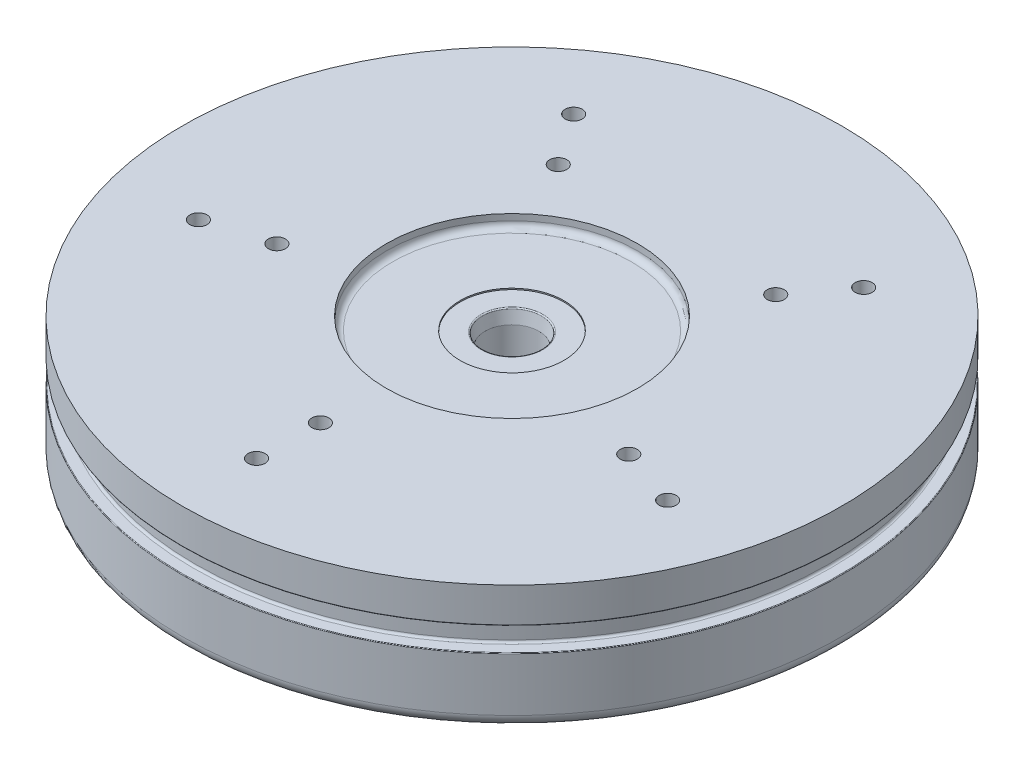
ISO-10303-21;
HEADER;
FILE_DESCRIPTION(('STEP AP214'),'2;1');
FILE_NAME('part.step','',(''),(''),'','','');
FILE_SCHEMA(('AUTOMOTIVE_DESIGN { 1 0 10303 214 1 1 1 1 }'));
ENDSEC;
DATA;
#1=APPLICATION_CONTEXT('core data for automotive mechanical design processes');
#2=APPLICATION_PROTOCOL_DEFINITION('international standard','automotive_design',2000,#1);
#3=PRODUCT_CONTEXT('',#1,'mechanical');
#4=PRODUCT('Part','Part','',(#3));
#5=PRODUCT_RELATED_PRODUCT_CATEGORY('part','',(#4));
#6=PRODUCT_DEFINITION_FORMATION('','',#4);
#7=PRODUCT_DEFINITION_CONTEXT('part definition',#1,'design');
#8=PRODUCT_DEFINITION('design','',#6,#7);
#9=PRODUCT_DEFINITION_SHAPE('','',#8);
#10=(LENGTH_UNIT() NAMED_UNIT(*) SI_UNIT(.MILLI.,.METRE.));
#11=(NAMED_UNIT(*) PLANE_ANGLE_UNIT() SI_UNIT($,.RADIAN.));
#12=(NAMED_UNIT(*) SI_UNIT($,.STERADIAN.) SOLID_ANGLE_UNIT());
#13=UNCERTAINTY_MEASURE_WITH_UNIT(LENGTH_MEASURE(1.E-05),#10,'distance_accuracy_value','');
#14=(GEOMETRIC_REPRESENTATION_CONTEXT(3) GLOBAL_UNCERTAINTY_ASSIGNED_CONTEXT((#13)) GLOBAL_UNIT_ASSIGNED_CONTEXT((#10,
#11,#12)) REPRESENTATION_CONTEXT('',''));
#15=CARTESIAN_POINT('',(0.,0.,0.));
#16=DIRECTION('',(0.,0.,1.));
#17=DIRECTION('',(1.,0.,0.));
#18=AXIS2_PLACEMENT_3D('',#15,#16,#17);
#19=CARTESIAN_POINT('',(-66.675,25.4,0.));
#20=DIRECTION('',(0.,-1.,0.));
#21=DIRECTION('',(0.,0.,-1.));
#22=AXIS2_PLACEMENT_3D('',#19,#20,#21);
#23=PLANE('',#22);
#24=CARTESIAN_POINT('',(0.,25.4,0.));
#25=DIRECTION('',(0.,1.,0.));
#26=DIRECTION('',(0.,0.,1.));
#27=AXIS2_PLACEMENT_3D('',#24,#25,#26);
#28=CIRCLE('',#27,25.4);
#29=CARTESIAN_POINT('',(0.,25.4,25.4));
#30=VERTEX_POINT('',#29);
#31=EDGE_CURVE('E94',#30,#30,#28,.T.);
#32=ORIENTED_EDGE('',*,*,#31,.F.);
#33=EDGE_LOOP('',(#32));
#34=FACE_BOUND('',#33,.T.);
#35=CARTESIAN_POINT('',(22.9291523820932,25.4,-30.4280129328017));
#36=DIRECTION('',(0.,1.,0.));
#37=DIRECTION('',(0.,0.,1.));
#38=AXIS2_PLACEMENT_3D('',#35,#36,#37);
#39=CIRCLE('',#38,1.72719999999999);
#40=CARTESIAN_POINT('',(22.9291523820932,25.4,-28.7008129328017));
#41=VERTEX_POINT('',#40);
#42=EDGE_CURVE('E88',#41,#41,#39,.T.);
#43=ORIENTED_EDGE('',*,*,#42,.F.);
#44=EDGE_LOOP('',(#43));
#45=FACE_BOUND('',#44,.T.);
#46=CARTESIAN_POINT('',(-21.8532622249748,25.4,-31.2096928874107));
#47=DIRECTION('',(0.,1.,0.));
#48=DIRECTION('',(0.,0.,1.));
#49=AXIS2_PLACEMENT_3D('',#46,#47,#48);
#50=CIRCLE('',#49,1.72719999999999);
#51=CARTESIAN_POINT('',(-21.8532622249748,25.4,-29.4824928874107));
#52=VERTEX_POINT('',#51);
#53=EDGE_CURVE('E100',#52,#52,#50,.T.);
#54=ORIENTED_EDGE('',*,*,#53,.F.);
#55=EDGE_LOOP('',(#54));
#56=FACE_BOUND('',#55,.T.);
#57=CARTESIAN_POINT('',(-29.137682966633,25.4,-41.6129238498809));
#58=DIRECTION('',(0.,1.,0.));
#59=DIRECTION('',(0.,0.,1.));
#60=AXIS2_PLACEMENT_3D('',#57,#58,#59);
#61=CIRCLE('',#60,1.72719999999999);
#62=CARTESIAN_POINT('',(-29.137682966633,25.4,-39.8857238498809));
#63=VERTEX_POINT('',#62);
#64=EDGE_CURVE('E106',#63,#63,#61,.T.);
#65=ORIENTED_EDGE('',*,*,#64,.F.);
#66=EDGE_LOOP('',(#65));
#67=FACE_BOUND('',#66,.T.);
#68=CARTESIAN_POINT('',(-36.4352112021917,25.4,11.1393619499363));
#69=DIRECTION('',(0.,1.,0.));
#70=DIRECTION('',(0.,0.,1.));
#71=AXIS2_PLACEMENT_3D('',#68,#69,#70);
#72=CIRCLE('',#71,1.72719999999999);
#73=CARTESIAN_POINT('',(-36.4352112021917,25.4,12.8665619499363));
#74=VERTEX_POINT('',#73);
#75=EDGE_CURVE('E112',#74,#74,#72,.T.);
#76=ORIENTED_EDGE('',*,*,#75,.F.);
#77=EDGE_LOOP('',(#76));
#78=FACE_BOUND('',#77,.T.);
#79=CARTESIAN_POINT('',(-48.5802816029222,25.4,14.852482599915));
#80=DIRECTION('',(0.,1.,0.));
#81=DIRECTION('',(0.,0.,1.));
#82=AXIS2_PLACEMENT_3D('',#79,#80,#81);
#83=CIRCLE('',#82,1.72719999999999);
#84=CARTESIAN_POINT('',(-48.5802816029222,25.4,16.579682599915));
#85=VERTEX_POINT('',#84);
#86=EDGE_CURVE('E118',#85,#85,#83,.T.);
#87=ORIENTED_EDGE('',*,*,#86,.F.);
#88=EDGE_LOOP('',(#87));
#89=FACE_BOUND('',#88,.T.);
#90=CARTESIAN_POINT('',(-0.664936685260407,25.4,38.0941971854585));
#91=DIRECTION('',(0.,1.,0.));
#92=DIRECTION('',(0.,0.,1.));
#93=AXIS2_PLACEMENT_3D('',#90,#91,#92);
#94=CIRCLE('',#93,1.72719999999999);
#95=CARTESIAN_POINT('',(-0.664936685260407,25.4,39.8213971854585));
#96=VERTEX_POINT('',#95);
#97=EDGE_CURVE('E124',#96,#96,#94,.T.);
#98=ORIENTED_EDGE('',*,*,#97,.F.);
#99=EDGE_LOOP('',(#98));
#100=FACE_BOUND('',#99,.T.);
#101=CARTESIAN_POINT('',(-0.886582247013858,25.4,50.7922629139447));
#102=DIRECTION('',(0.,1.,0.));
#103=DIRECTION('',(0.,0.,1.));
#104=AXIS2_PLACEMENT_3D('',#101,#102,#103);
#105=CIRCLE('',#104,1.72719999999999);
#106=CARTESIAN_POINT('',(-0.886582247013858,25.4,52.5194629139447));
#107=VERTEX_POINT('',#106);
#108=EDGE_CURVE('E130',#107,#107,#105,.T.);
#109=ORIENTED_EDGE('',*,*,#108,.F.);
#110=EDGE_LOOP('',(#109));
#111=FACE_BOUND('',#110,.T.);
#112=CARTESIAN_POINT('',(36.0242577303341,25.4,12.4041466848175));
#113=DIRECTION('',(0.,1.,0.));
#114=DIRECTION('',(0.,0.,1.));
#115=AXIS2_PLACEMENT_3D('',#112,#113,#114);
#116=CIRCLE('',#115,1.72719999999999);
#117=CARTESIAN_POINT('',(36.0242577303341,25.4,14.1313466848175));
#118=VERTEX_POINT('',#117);
#119=EDGE_CURVE('E136',#118,#118,#116,.T.);
#120=ORIENTED_EDGE('',*,*,#119,.F.);
#121=EDGE_LOOP('',(#120));
#122=FACE_BOUND('',#121,.T.);
#123=CARTESIAN_POINT('',(48.0323436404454,25.4,16.5388622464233));
#124=DIRECTION('',(0.,1.,0.));
#125=DIRECTION('',(0.,0.,1.));
#126=AXIS2_PLACEMENT_3D('',#123,#124,#125);
#127=CIRCLE('',#126,1.72719999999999);
#128=CARTESIAN_POINT('',(48.0323436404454,25.4,18.2660622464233));
#129=VERTEX_POINT('',#128);
#130=EDGE_CURVE('E142',#129,#129,#127,.T.);
#131=ORIENTED_EDGE('',*,*,#130,.F.);
#132=EDGE_LOOP('',(#131));
#133=FACE_BOUND('',#132,.T.);
#134=CARTESIAN_POINT('',(0.,25.4,0.));
#135=DIRECTION('',(0.,-1.,0.));
#136=DIRECTION('',(0.,0.,-1.));
#137=AXIS2_PLACEMENT_3D('',#134,#135,#136);
#138=CIRCLE('',#137,66.675);
#139=CARTESIAN_POINT('',(0.,25.4,-66.675));
#140=VERTEX_POINT('',#139);
#141=EDGE_CURVE('E169',#140,#140,#138,.T.);
#142=ORIENTED_EDGE('',*,*,#141,.F.);
#143=EDGE_LOOP('',(#142));
#144=FACE_BOUND('',#143,.T.);
#145=CARTESIAN_POINT('',(30.5722031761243,25.4,-40.5706839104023));
#146=DIRECTION('',(0.,1.,0.));
#147=DIRECTION('',(0.,0.,1.));
#148=AXIS2_PLACEMENT_3D('',#145,#146,#147);
#149=CIRCLE('',#148,1.72719999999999);
#150=CARTESIAN_POINT('',(30.5722031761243,25.4,-38.8434839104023));
#151=VERTEX_POINT('',#150);
#152=EDGE_CURVE('E87',#151,#151,#149,.T.);
#153=ORIENTED_EDGE('',*,*,#152,.F.);
#154=EDGE_LOOP('',(#153));
#155=FACE_BOUND('',#154,.T.);
#156=ADVANCED_FACE('F37',(#34,#45,#56,#67,#78,#89,#100,#111,#122,#133,#144,#155),#23,.F.);
#157=CARTESIAN_POINT('',(0.,13.335,0.));
#158=DIRECTION('',(0.,-1.,0.));
#159=DIRECTION('',(0.,0.,-1.));
#160=AXIS2_PLACEMENT_3D('',#157,#158,#159);
#161=TOROIDAL_SURFACE('',#160,66.548,0.127000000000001);
#162=CARTESIAN_POINT('',(0.,13.335,0.));
#163=DIRECTION('',(0.,-1.,0.));
#164=DIRECTION('',(0.,0.,-1.));
#165=AXIS2_PLACEMENT_3D('',#162,#163,#164);
#166=CIRCLE('',#165,66.675);
#167=CARTESIAN_POINT('',(0.,13.335,-66.675));
#168=VERTEX_POINT('',#167);
#169=EDGE_CURVE('E175',#168,#168,#166,.T.);
#170=ORIENTED_EDGE('',*,*,#169,.F.);
#171=EDGE_LOOP('',(#170));
#172=FACE_BOUND('',#171,.T.);
#173=CARTESIAN_POINT('',(0.,13.462,0.));
#174=DIRECTION('',(0.,-1.,0.));
#175=DIRECTION('',(0.,0.,-1.));
#176=AXIS2_PLACEMENT_3D('',#173,#174,#175);
#177=CIRCLE('',#176,66.548);
#178=CARTESIAN_POINT('',(0.,13.462,-66.548));
#179=VERTEX_POINT('',#178);
#180=EDGE_CURVE('E148',#179,#179,#177,.T.);
#181=ORIENTED_EDGE('',*,*,#180,.T.);
#182=EDGE_LOOP('',(#181));
#183=FACE_BOUND('',#182,.T.);
#184=ADVANCED_FACE('F206',(#172,#183),#161,.T.);
#185=CARTESIAN_POINT('',(0.,12.7,0.));
#186=DIRECTION('',(0.,-1.,0.));
#187=DIRECTION('',(0.,0.,-1.));
#188=AXIS2_PLACEMENT_3D('',#185,#186,#187);
#189=CYLINDRICAL_SURFACE('',#188,66.675);
#190=CARTESIAN_POINT('',(0.,2.54,0.));
#191=DIRECTION('',(0.,1.,0.));
#192=DIRECTION('',(0.,0.,1.));
#193=AXIS2_PLACEMENT_3D('',#190,#191,#192);
#194=CIRCLE('',#193,66.675);
#195=CARTESIAN_POINT('',(0.,2.54,66.675));
#196=VERTEX_POINT('',#195);
#197=EDGE_CURVE('E182',#196,#196,#194,.T.);
#198=ORIENTED_EDGE('',*,*,#197,.T.);
#199=EDGE_LOOP('',(#198));
#200=FACE_BOUND('',#199,.T.);
#201=ORIENTED_EDGE('',*,*,#169,.T.);
#202=EDGE_LOOP('',(#201));
#203=FACE_BOUND('',#202,.T.);
#204=ADVANCED_FACE('F212',(#200,#203),#189,.T.);
#205=CARTESIAN_POINT('',(-66.675,0.,0.));
#206=DIRECTION('',(0.,1.,0.));
#207=DIRECTION('',(0.,0.,1.));
#208=AXIS2_PLACEMENT_3D('',#205,#206,#207);
#209=PLANE('',#208);
#210=CARTESIAN_POINT('',(0.,0.,0.));
#211=DIRECTION('',(0.,1.,0.));
#212=DIRECTION('',(0.,0.,1.));
#213=AXIS2_PLACEMENT_3D('',#210,#211,#212);
#214=CIRCLE('',#213,64.135);
#215=CARTESIAN_POINT('',(0.,0.,64.135));
#216=VERTEX_POINT('',#215);
#217=EDGE_CURVE('E178',#216,#216,#214,.F.);
#218=ORIENTED_EDGE('',*,*,#217,.T.);
#219=EDGE_LOOP('',(#218));
#220=FACE_BOUND('',#219,.T.);
#221=CARTESIAN_POINT('',(0.,0.,0.));
#222=DIRECTION('',(0.,-1.,0.));
#223=DIRECTION('',(0.,0.,-1.));
#224=AXIS2_PLACEMENT_3D('',#221,#222,#223);
#225=CIRCLE('',#224,53.975);
#226=CARTESIAN_POINT('',(0.,0.,-53.975));
#227=VERTEX_POINT('',#226);
#228=EDGE_CURVE('E172',#227,#227,#225,.T.);
#229=ORIENTED_EDGE('',*,*,#228,.F.);
#230=EDGE_LOOP('',(#229));
#231=FACE_BOUND('',#230,.T.);
#232=ADVANCED_FACE('F224',(#220,#231),#209,.F.);
#233=CARTESIAN_POINT('',(0.,0.,0.));
#234=DIRECTION('',(0.,-1.,0.));
#235=DIRECTION('',(0.,0.,-1.));
#236=AXIS2_PLACEMENT_3D('',#233,#234,#235);
#237=CONICAL_SURFACE('',#236,53.975,1.339705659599);
#238=CARTESIAN_POINT('',(0.,11.3926470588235,0.));
#239=DIRECTION('',(0.,-1.,0.));
#240=DIRECTION('',(0.,0.,-1.));
#241=AXIS2_PLACEMENT_3D('',#238,#239,#240);
#242=CIRCLE('',#241,5.55625);
#243=CARTESIAN_POINT('',(0.,11.3926470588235,-5.55625));
#244=VERTEX_POINT('',#243);
#245=EDGE_CURVE('E41',#244,#244,#242,.F.);
#246=CARTESIAN_POINT('',(0.,11.3926470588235,-5.55625));
#247=CARTESIAN_POINT('',(0.,11.2739736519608,-6.06061197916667));
#248=CARTESIAN_POINT('',(0.,11.155300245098,-6.56497395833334));
#249=CARTESIAN_POINT('',(0.,10.9179534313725,-7.57369791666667));
#250=CARTESIAN_POINT('',(0.,10.7992800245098,-8.07805989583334));
#251=CARTESIAN_POINT('',(0.,10.5619332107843,-9.08678385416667));
#252=CARTESIAN_POINT('',(0.,10.4432598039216,-9.59114583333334));
#253=CARTESIAN_POINT('',(0.,10.2059129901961,-10.5998697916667));
#254=CARTESIAN_POINT('',(0.,10.0872395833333,-11.1042317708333));
#255=CARTESIAN_POINT('',(0.,9.84989276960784,-12.1129557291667));
#256=CARTESIAN_POINT('',(0.,9.7312193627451,-12.6173177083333));
#257=CARTESIAN_POINT('',(0.,9.49387254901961,-13.6260416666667));
#258=CARTESIAN_POINT('',(0.,9.37519914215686,-14.1304036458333));
#259=CARTESIAN_POINT('',(0.,9.13785232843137,-15.1391276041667));
#260=CARTESIAN_POINT('',(0.,9.01917892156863,-15.6434895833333));
#261=CARTESIAN_POINT('',(0.,8.78183210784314,-16.6522135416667));
#262=CARTESIAN_POINT('',(0.,8.66315870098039,-17.1565755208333));
#263=CARTESIAN_POINT('',(0.,8.4258118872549,-18.1652994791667));
#264=CARTESIAN_POINT('',(0.,8.30713848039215,-18.6696614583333));
#265=CARTESIAN_POINT('',(0.,8.06979166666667,-19.6783854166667));
#266=CARTESIAN_POINT('',(0.,7.95111825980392,-20.1827473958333));
#267=CARTESIAN_POINT('',(0.,7.71377144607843,-21.1914713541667));
#268=CARTESIAN_POINT('',(0.,7.59509803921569,-21.6958333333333));
#269=CARTESIAN_POINT('',(0.,7.35775122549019,-22.7045572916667));
#270=CARTESIAN_POINT('',(0.,7.23907781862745,-23.2089192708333));
#271=CARTESIAN_POINT('',(0.,7.00173100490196,-24.2176432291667));
#272=CARTESIAN_POINT('',(0.,6.88305759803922,-24.7220052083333));
#273=CARTESIAN_POINT('',(0.,6.64571078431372,-25.7307291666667));
#274=CARTESIAN_POINT('',(0.,6.52703737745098,-26.2350911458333));
#275=CARTESIAN_POINT('',(0.,6.28969056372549,-27.2438151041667));
#276=CARTESIAN_POINT('',(0.,6.17101715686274,-27.7481770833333));
#277=CARTESIAN_POINT('',(0.,5.93367034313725,-28.7569010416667));
#278=CARTESIAN_POINT('',(0.,5.81499693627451,-29.2612630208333));
#279=CARTESIAN_POINT('',(0.,5.57765012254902,-30.2699869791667));
#280=CARTESIAN_POINT('',(0.,5.45897671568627,-30.7743489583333));
#281=CARTESIAN_POINT('',(0.,5.22162990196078,-31.7830729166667));
#282=CARTESIAN_POINT('',(0.,5.10295649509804,-32.2874348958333));
#283=CARTESIAN_POINT('',(0.,4.86560968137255,-33.2961588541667));
#284=CARTESIAN_POINT('',(0.,4.7469362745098,-33.8005208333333));
#285=CARTESIAN_POINT('',(0.,4.50958946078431,-34.8092447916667));
#286=CARTESIAN_POINT('',(0.,4.39091605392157,-35.3136067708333));
#287=CARTESIAN_POINT('',(0.,4.15356924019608,-36.3223307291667));
#288=CARTESIAN_POINT('',(0.,4.03489583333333,-36.8266927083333));
#289=CARTESIAN_POINT('',(0.,3.79754901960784,-37.8354166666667));
#290=CARTESIAN_POINT('',(0.,3.6788756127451,-38.3397786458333));
#291=CARTESIAN_POINT('',(0.,3.44152879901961,-39.3485026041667));
#292=CARTESIAN_POINT('',(0.,3.32285539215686,-39.8528645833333));
#293=CARTESIAN_POINT('',(0.,3.08550857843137,-40.8615885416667));
#294=CARTESIAN_POINT('',(0.,2.96683517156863,-41.3659505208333));
#295=CARTESIAN_POINT('',(0.,2.72948835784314,-42.3746744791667));
#296=CARTESIAN_POINT('',(0.,2.61081495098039,-42.8790364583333));
#297=CARTESIAN_POINT('',(0.,2.3734681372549,-43.8877604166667));
#298=CARTESIAN_POINT('',(0.,2.25479473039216,-44.3921223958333));
#299=CARTESIAN_POINT('',(0.,2.01744791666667,-45.4008463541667));
#300=CARTESIAN_POINT('',(0.,1.89877450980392,-45.9052083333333));
#301=CARTESIAN_POINT('',(0.,1.66142769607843,-46.9139322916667));
#302=CARTESIAN_POINT('',(0.,1.54275428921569,-47.4182942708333));
#303=CARTESIAN_POINT('',(0.,1.3054074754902,-48.4270182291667));
#304=CARTESIAN_POINT('',(0.,1.18673406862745,-48.9313802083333));
#305=CARTESIAN_POINT('',(0.,0.949387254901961,-49.9401041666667));
#306=CARTESIAN_POINT('',(0.,0.830713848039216,-50.4444661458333));
#307=CARTESIAN_POINT('',(0.,0.593367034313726,-51.4531901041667));
#308=CARTESIAN_POINT('',(0.,0.474693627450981,-51.9575520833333));
#309=CARTESIAN_POINT('',(0.,0.237346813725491,-52.9662760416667));
#310=CARTESIAN_POINT('',(0.,0.118673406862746,-53.4706380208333));
#311=CARTESIAN_POINT('',(0.,0.,-53.975));
#312=B_SPLINE_CURVE_WITH_KNOTS('',3,(#246,#247,#248,#249,#250,#251,#252,#253,#254,#255,#256,
#257,#258,#259,#260,#261,#262,#263,#264,#265,#266,#267,#268,#269,#270,#271,#272,#273,#274,#275,
#276,#277,#278,#279,#280,#281,#282,#283,#284,#285,#286,#287,#288,#289,#290,#291,#292,#293,#294,
#295,#296,#297,#298,#299,#300,#301,#302,#303,#304,#305,#306,#307,#308,#309,#310,#311),
.UNSPECIFIED.,.F.,.F.,(4,2,2,2,2,2,2,2,2,2,2,2,2,2,2,2,2,2,2,2,2,2,2,2,2,2,2,2,2,2,2,2,4),(0.,
1.55440646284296,3.10881292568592,4.66321938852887,6.21762585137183,7.77203231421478,
9.32643877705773,10.8808452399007,12.4352517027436,13.9896581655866,15.5440646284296,
17.0984710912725,18.6528775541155,20.2072840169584,21.7616904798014,23.3160969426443,
24.8705034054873,26.4249098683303,27.9793163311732,29.5337227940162,31.0881292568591,
32.6425357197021,34.196942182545,35.751348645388,37.3057551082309,38.8601615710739,
40.4145680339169,41.9689744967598,43.5233809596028,45.0777874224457,46.6321938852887,
48.1866003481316,49.7410068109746),.UNSPECIFIED.);
#313=EDGE_CURVE('BSEAM221',#244,#227,#312,.T.);
#314=ORIENTED_EDGE('',*,*,#245,.T.);
#315=ORIENTED_EDGE('',*,*,#228,.T.);
#316=ORIENTED_EDGE('',*,*,#313,.T.);
#317=ORIENTED_EDGE('',*,*,#313,.F.);
#318=EDGE_LOOP('',(#314,#316,#315,#317));
#319=FACE_BOUND('',#318,.T.);
#320=ADVANCED_FACE('F221',(#319),#237,.F.);
#321=CARTESIAN_POINT('',(0.,12.7,0.));
#322=DIRECTION('',(0.,-1.,0.));
#323=DIRECTION('',(0.,0.,-1.));
#324=AXIS2_PLACEMENT_3D('',#321,#322,#323);
#325=CYLINDRICAL_SURFACE('',#324,66.675);
#326=CARTESIAN_POINT('',(0.,18.415,0.));
#327=DIRECTION('',(0.,-1.,0.));
#328=DIRECTION('',(0.,0.,-1.));
#329=AXIS2_PLACEMENT_3D('',#326,#327,#328);
#330=CIRCLE('',#329,66.675);
#331=CARTESIAN_POINT('',(0.,18.415,-66.675));
#332=VERTEX_POINT('',#331);
#333=EDGE_CURVE('E166',#332,#332,#330,.T.);
#334=ORIENTED_EDGE('',*,*,#333,.F.);
#335=EDGE_LOOP('',(#334));
#336=FACE_BOUND('',#335,.T.);
#337=ORIENTED_EDGE('',*,*,#141,.T.);
#338=EDGE_LOOP('',(#337));
#339=FACE_BOUND('',#338,.T.);
#340=ADVANCED_FACE('F219',(#336,#339),#325,.T.);
#341=CARTESIAN_POINT('',(0.,18.415,0.));
#342=DIRECTION('',(0.,-1.,0.));
#343=DIRECTION('',(0.,0.,-1.));
#344=AXIS2_PLACEMENT_3D('',#341,#342,#343);
#345=TOROIDAL_SURFACE('',#344,66.548,0.127);
#346=CARTESIAN_POINT('',(0.,18.288,0.));
#347=DIRECTION('',(0.,-1.,0.));
#348=DIRECTION('',(0.,0.,-1.));
#349=AXIS2_PLACEMENT_3D('',#346,#347,#348);
#350=CIRCLE('',#349,66.548);
#351=CARTESIAN_POINT('',(0.,18.288,-66.548));
#352=VERTEX_POINT('',#351);
#353=EDGE_CURVE('E163',#352,#352,#350,.T.);
#354=ORIENTED_EDGE('',*,*,#353,.F.);
#355=EDGE_LOOP('',(#354));
#356=FACE_BOUND('',#355,.T.);
#357=ORIENTED_EDGE('',*,*,#333,.T.);
#358=EDGE_LOOP('',(#357));
#359=FACE_BOUND('',#358,.T.);
#360=ADVANCED_FACE('F278',(#356,#359),#345,.T.);
#361=CARTESIAN_POINT('',(-64.4779,18.288,0.));
#362=DIRECTION('',(0.,1.,0.));
#363=DIRECTION('',(0.,0.,1.));
#364=AXIS2_PLACEMENT_3D('',#361,#362,#363);
#365=PLANE('',#364);
#366=CARTESIAN_POINT('',(0.,18.288,0.));
#367=DIRECTION('',(0.,-1.,0.));
#368=DIRECTION('',(0.,0.,-1.));
#369=AXIS2_PLACEMENT_3D('',#366,#367,#368);
#370=CIRCLE('',#369,64.4779);
#371=CARTESIAN_POINT('',(0.,18.288,-64.4779));
#372=VERTEX_POINT('',#371);
#373=EDGE_CURVE('E160',#372,#372,#370,.T.);
#374=ORIENTED_EDGE('',*,*,#373,.F.);
#375=EDGE_LOOP('',(#374));
#376=FACE_BOUND('',#375,.T.);
#377=ORIENTED_EDGE('',*,*,#353,.T.);
#378=EDGE_LOOP('',(#377));
#379=FACE_BOUND('',#378,.T.);
#380=ADVANCED_FACE('F272',(#376,#379),#365,.F.);
#381=CARTESIAN_POINT('',(0.,17.8435,0.));
#382=DIRECTION('',(0.,-1.,0.));
#383=DIRECTION('',(0.,0.,-1.));
#384=AXIS2_PLACEMENT_3D('',#381,#382,#383);
#385=TOROIDAL_SURFACE('',#384,64.4779,0.4445);
#386=CARTESIAN_POINT('',(0.,17.8435,0.));
#387=DIRECTION('',(0.,-1.,0.));
#388=DIRECTION('',(0.,0.,-1.));
#389=AXIS2_PLACEMENT_3D('',#386,#387,#388);
#390=CIRCLE('',#389,64.0334);
#391=CARTESIAN_POINT('',(0.,17.8435,-64.0334));
#392=VERTEX_POINT('',#391);
#393=EDGE_CURVE('E157',#392,#392,#390,.T.);
#394=ORIENTED_EDGE('',*,*,#393,.F.);
#395=EDGE_LOOP('',(#394));
#396=FACE_BOUND('',#395,.T.);
#397=ORIENTED_EDGE('',*,*,#373,.T.);
#398=EDGE_LOOP('',(#397));
#399=FACE_BOUND('',#398,.T.);
#400=ADVANCED_FACE('F266',(#396,#399),#385,.F.);
#401=CARTESIAN_POINT('',(0.,12.7,0.));
#402=DIRECTION('',(0.,-1.,0.));
#403=DIRECTION('',(0.,0.,-1.));
#404=AXIS2_PLACEMENT_3D('',#401,#402,#403);
#405=CYLINDRICAL_SURFACE('',#404,64.0334);
#406=CARTESIAN_POINT('',(0.,13.9065,0.));
#407=DIRECTION('',(0.,-1.,0.));
#408=DIRECTION('',(0.,0.,-1.));
#409=AXIS2_PLACEMENT_3D('',#406,#407,#408);
#410=CIRCLE('',#409,64.0334);
#411=CARTESIAN_POINT('',(0.,13.9065,-64.0334));
#412=VERTEX_POINT('',#411);
#413=EDGE_CURVE('E154',#412,#412,#410,.T.);
#414=ORIENTED_EDGE('',*,*,#413,.F.);
#415=EDGE_LOOP('',(#414));
#416=FACE_BOUND('',#415,.T.);
#417=ORIENTED_EDGE('',*,*,#393,.T.);
#418=EDGE_LOOP('',(#417));
#419=FACE_BOUND('',#418,.T.);
#420=ADVANCED_FACE('F260',(#416,#419),#405,.T.);
#421=CARTESIAN_POINT('',(0.,13.9065,0.));
#422=DIRECTION('',(0.,-1.,0.));
#423=DIRECTION('',(0.,0.,-1.));
#424=AXIS2_PLACEMENT_3D('',#421,#422,#423);
#425=TOROIDAL_SURFACE('',#424,64.4779,0.4445);
#426=CARTESIAN_POINT('',(0.,13.462,0.));
#427=DIRECTION('',(0.,-1.,0.));
#428=DIRECTION('',(0.,0.,-1.));
#429=AXIS2_PLACEMENT_3D('',#426,#427,#428);
#430=CIRCLE('',#429,64.4779);
#431=CARTESIAN_POINT('',(0.,13.462,-64.4779));
#432=VERTEX_POINT('',#431);
#433=EDGE_CURVE('E151',#432,#432,#430,.T.);
#434=ORIENTED_EDGE('',*,*,#433,.F.);
#435=EDGE_LOOP('',(#434));
#436=FACE_BOUND('',#435,.T.);
#437=ORIENTED_EDGE('',*,*,#413,.T.);
#438=EDGE_LOOP('',(#437));
#439=FACE_BOUND('',#438,.T.);
#440=ADVANCED_FACE('F242',(#436,#439),#425,.F.);
#441=CARTESIAN_POINT('',(-64.4779,13.462,0.));
#442=DIRECTION('',(0.,-1.,0.));
#443=DIRECTION('',(0.,0.,-1.));
#444=AXIS2_PLACEMENT_3D('',#441,#442,#443);
#445=PLANE('',#444);
#446=ORIENTED_EDGE('',*,*,#180,.F.);
#447=EDGE_LOOP('',(#446));
#448=FACE_BOUND('',#447,.T.);
#449=ORIENTED_EDGE('',*,*,#433,.T.);
#450=EDGE_LOOP('',(#449));
#451=FACE_BOUND('',#450,.T.);
#452=ADVANCED_FACE('F234',(#448,#451),#445,.F.);
#453=CARTESIAN_POINT('',(0.,2.54,0.));
#454=DIRECTION('',(0.,1.,0.));
#455=DIRECTION('',(0.,0.,1.));
#456=AXIS2_PLACEMENT_3D('',#453,#454,#455);
#457=TOROIDAL_SURFACE('',#456,64.135,2.54);
#458=ORIENTED_EDGE('',*,*,#197,.F.);
#459=EDGE_LOOP('',(#458));
#460=FACE_BOUND('',#459,.T.);
#461=ORIENTED_EDGE('',*,*,#217,.F.);
#462=EDGE_LOOP('',(#461));
#463=FACE_BOUND('',#462,.T.);
#464=ADVANCED_FACE('F231',(#460,#463),#457,.T.);
#465=CARTESIAN_POINT('',(48.0323436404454,16.6624,16.5388622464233));
#466=DIRECTION('',(0.,1.,0.));
#467=DIRECTION('',(0.,0.,1.));
#468=AXIS2_PLACEMENT_3D('',#465,#466,#467);
#469=CONICAL_SURFACE('',#468,1.7272,1.02974425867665);
#470=CARTESIAN_POINT('',(48.0323436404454,15.6245935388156,16.5388622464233));
#471=VERTEX_POINT('',#470);
#472=VERTEX_LOOP('',#471);
#473=FACE_BOUND('',#472,.T.);
#474=CARTESIAN_POINT('',(48.0323436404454,16.6624,16.5388622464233));
#475=DIRECTION('',(0.,1.,0.));
#476=DIRECTION('',(0.,0.,1.));
#477=AXIS2_PLACEMENT_3D('',#474,#475,#476);
#478=CIRCLE('',#477,1.7272);
#479=CARTESIAN_POINT('',(48.0323436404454,16.6624,18.2660622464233));
#480=VERTEX_POINT('',#479);
#481=EDGE_CURVE('E145',#480,#480,#478,.T.);
#482=ORIENTED_EDGE('',*,*,#481,.T.);
#483=EDGE_LOOP('',(#482));
#484=FACE_BOUND('',#483,.T.);
#485=ADVANCED_FACE('F233',(#473,#484),#469,.F.);
#486=CARTESIAN_POINT('',(48.0323436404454,25.4,16.5388622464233));
#487=DIRECTION('',(0.,1.,0.));
#488=DIRECTION('',(0.,0.,1.));
#489=AXIS2_PLACEMENT_3D('',#486,#487,#488);
#490=CYLINDRICAL_SURFACE('',#489,1.72719999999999);
#491=ORIENTED_EDGE('',*,*,#481,.F.);
#492=EDGE_LOOP('',(#491));
#493=FACE_BOUND('',#492,.T.);
#494=ORIENTED_EDGE('',*,*,#130,.T.);
#495=EDGE_LOOP('',(#494));
#496=FACE_BOUND('',#495,.T.);
#497=ADVANCED_FACE('F240',(#493,#496),#490,.F.);
#498=CARTESIAN_POINT('',(36.0242577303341,16.6624,12.4041466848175));
#499=DIRECTION('',(0.,1.,0.));
#500=DIRECTION('',(0.,0.,1.));
#501=AXIS2_PLACEMENT_3D('',#498,#499,#500);
#502=CONICAL_SURFACE('',#501,1.7272,1.02974425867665);
#503=CARTESIAN_POINT('',(36.0242577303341,15.6245935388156,12.4041466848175));
#504=VERTEX_POINT('',#503);
#505=VERTEX_LOOP('',#504);
#506=FACE_BOUND('',#505,.T.);
#507=CARTESIAN_POINT('',(36.0242577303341,16.6624,12.4041466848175));
#508=DIRECTION('',(0.,1.,0.));
#509=DIRECTION('',(0.,0.,1.));
#510=AXIS2_PLACEMENT_3D('',#507,#508,#509);
#511=CIRCLE('',#510,1.7272);
#512=CARTESIAN_POINT('',(36.0242577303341,16.6624,14.1313466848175));
#513=VERTEX_POINT('',#512);
#514=EDGE_CURVE('E139',#513,#513,#511,.T.);
#515=ORIENTED_EDGE('',*,*,#514,.T.);
#516=EDGE_LOOP('',(#515));
#517=FACE_BOUND('',#516,.T.);
#518=ADVANCED_FACE('F356',(#506,#517),#502,.F.);
#519=CARTESIAN_POINT('',(36.0242577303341,25.4,12.4041466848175));
#520=DIRECTION('',(0.,1.,0.));
#521=DIRECTION('',(0.,0.,1.));
#522=AXIS2_PLACEMENT_3D('',#519,#520,#521);
#523=CYLINDRICAL_SURFACE('',#522,1.72719999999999);
#524=ORIENTED_EDGE('',*,*,#514,.F.);
#525=EDGE_LOOP('',(#524));
#526=FACE_BOUND('',#525,.T.);
#527=ORIENTED_EDGE('',*,*,#119,.T.);
#528=EDGE_LOOP('',(#527));
#529=FACE_BOUND('',#528,.T.);
#530=ADVANCED_FACE('F352',(#526,#529),#523,.F.);
#531=CARTESIAN_POINT('',(-0.886582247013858,16.6624,50.7922629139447));
#532=DIRECTION('',(0.,1.,0.));
#533=DIRECTION('',(0.,0.,1.));
#534=AXIS2_PLACEMENT_3D('',#531,#532,#533);
#535=CONICAL_SURFACE('',#534,1.7272,1.02974425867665);
#536=CARTESIAN_POINT('',(-0.88658224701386,15.6245935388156,50.7922629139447));
#537=VERTEX_POINT('',#536);
#538=VERTEX_LOOP('',#537);
#539=FACE_BOUND('',#538,.T.);
#540=CARTESIAN_POINT('',(-0.886582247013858,16.6624,50.7922629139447));
#541=DIRECTION('',(0.,1.,0.));
#542=DIRECTION('',(0.,0.,1.));
#543=AXIS2_PLACEMENT_3D('',#540,#541,#542);
#544=CIRCLE('',#543,1.7272);
#545=CARTESIAN_POINT('',(-0.886582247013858,16.6624,52.5194629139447));
#546=VERTEX_POINT('',#545);
#547=EDGE_CURVE('E133',#546,#546,#544,.T.);
#548=ORIENTED_EDGE('',*,*,#547,.T.);
#549=EDGE_LOOP('',(#548));
#550=FACE_BOUND('',#549,.T.);
#551=ADVANCED_FACE('F348',(#539,#550),#535,.F.);
#552=CARTESIAN_POINT('',(-0.886582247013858,25.4,50.7922629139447));
#553=DIRECTION('',(0.,1.,0.));
#554=DIRECTION('',(0.,0.,1.));
#555=AXIS2_PLACEMENT_3D('',#552,#553,#554);
#556=CYLINDRICAL_SURFACE('',#555,1.72719999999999);
#557=ORIENTED_EDGE('',*,*,#547,.F.);
#558=EDGE_LOOP('',(#557));
#559=FACE_BOUND('',#558,.T.);
#560=ORIENTED_EDGE('',*,*,#108,.T.);
#561=EDGE_LOOP('',(#560));
#562=FACE_BOUND('',#561,.T.);
#563=ADVANCED_FACE('F344',(#559,#562),#556,.F.);
#564=CARTESIAN_POINT('',(-0.664936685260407,16.6624,38.0941971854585));
#565=DIRECTION('',(0.,1.,0.));
#566=DIRECTION('',(0.,0.,1.));
#567=AXIS2_PLACEMENT_3D('',#564,#565,#566);
#568=CONICAL_SURFACE('',#567,1.7272,1.02974425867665);
#569=CARTESIAN_POINT('',(-0.664936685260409,15.6245935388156,38.0941971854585));
#570=VERTEX_POINT('',#569);
#571=VERTEX_LOOP('',#570);
#572=FACE_BOUND('',#571,.T.);
#573=CARTESIAN_POINT('',(-0.664936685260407,16.6624,38.0941971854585));
#574=DIRECTION('',(0.,1.,0.));
#575=DIRECTION('',(0.,0.,1.));
#576=AXIS2_PLACEMENT_3D('',#573,#574,#575);
#577=CIRCLE('',#576,1.7272);
#578=CARTESIAN_POINT('',(-0.664936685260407,16.6624,39.8213971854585));
#579=VERTEX_POINT('',#578);
#580=EDGE_CURVE('E127',#579,#579,#577,.T.);
#581=ORIENTED_EDGE('',*,*,#580,.T.);
#582=EDGE_LOOP('',(#581));
#583=FACE_BOUND('',#582,.T.);
#584=ADVANCED_FACE('F340',(#572,#583),#568,.F.);
#585=CARTESIAN_POINT('',(-0.664936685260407,25.4,38.0941971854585));
#586=DIRECTION('',(0.,1.,0.));
#587=DIRECTION('',(0.,0.,1.));
#588=AXIS2_PLACEMENT_3D('',#585,#586,#587);
#589=CYLINDRICAL_SURFACE('',#588,1.72719999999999);
#590=ORIENTED_EDGE('',*,*,#580,.F.);
#591=EDGE_LOOP('',(#590));
#592=FACE_BOUND('',#591,.T.);
#593=ORIENTED_EDGE('',*,*,#97,.T.);
#594=EDGE_LOOP('',(#593));
#595=FACE_BOUND('',#594,.T.);
#596=ADVANCED_FACE('F336',(#592,#595),#589,.F.);
#597=CARTESIAN_POINT('',(-48.5802816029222,16.6624,14.852482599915));
#598=DIRECTION('',(0.,1.,0.));
#599=DIRECTION('',(0.,0.,1.));
#600=AXIS2_PLACEMENT_3D('',#597,#598,#599);
#601=CONICAL_SURFACE('',#600,1.7272,1.02974425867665);
#602=CARTESIAN_POINT('',(-48.5802816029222,15.6245935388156,14.852482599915));
#603=VERTEX_POINT('',#602);
#604=VERTEX_LOOP('',#603);
#605=FACE_BOUND('',#604,.T.);
#606=CARTESIAN_POINT('',(-48.5802816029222,16.6624,14.852482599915));
#607=DIRECTION('',(0.,1.,0.));
#608=DIRECTION('',(0.,0.,1.));
#609=AXIS2_PLACEMENT_3D('',#606,#607,#608);
#610=CIRCLE('',#609,1.7272);
#611=CARTESIAN_POINT('',(-48.5802816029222,16.6624,16.579682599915));
#612=VERTEX_POINT('',#611);
#613=EDGE_CURVE('E121',#612,#612,#610,.T.);
#614=ORIENTED_EDGE('',*,*,#613,.T.);
#615=EDGE_LOOP('',(#614));
#616=FACE_BOUND('',#615,.T.);
#617=ADVANCED_FACE('F332',(#605,#616),#601,.F.);
#618=CARTESIAN_POINT('',(-48.5802816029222,25.4,14.852482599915));
#619=DIRECTION('',(0.,1.,0.));
#620=DIRECTION('',(0.,0.,1.));
#621=AXIS2_PLACEMENT_3D('',#618,#619,#620);
#622=CYLINDRICAL_SURFACE('',#621,1.72719999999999);
#623=ORIENTED_EDGE('',*,*,#613,.F.);
#624=EDGE_LOOP('',(#623));
#625=FACE_BOUND('',#624,.T.);
#626=ORIENTED_EDGE('',*,*,#86,.T.);
#627=EDGE_LOOP('',(#626));
#628=FACE_BOUND('',#627,.T.);
#629=ADVANCED_FACE('F328',(#625,#628),#622,.F.);
#630=CARTESIAN_POINT('',(-36.4352112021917,16.6624,11.1393619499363));
#631=DIRECTION('',(0.,1.,0.));
#632=DIRECTION('',(0.,0.,1.));
#633=AXIS2_PLACEMENT_3D('',#630,#631,#632);
#634=CONICAL_SURFACE('',#633,1.7272,1.02974425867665);
#635=CARTESIAN_POINT('',(-36.4352112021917,15.6245935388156,11.1393619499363));
#636=VERTEX_POINT('',#635);
#637=VERTEX_LOOP('',#636);
#638=FACE_BOUND('',#637,.T.);
#639=CARTESIAN_POINT('',(-36.4352112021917,16.6624,11.1393619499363));
#640=DIRECTION('',(0.,1.,0.));
#641=DIRECTION('',(0.,0.,1.));
#642=AXIS2_PLACEMENT_3D('',#639,#640,#641);
#643=CIRCLE('',#642,1.7272);
#644=CARTESIAN_POINT('',(-36.4352112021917,16.6624,12.8665619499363));
#645=VERTEX_POINT('',#644);
#646=EDGE_CURVE('E115',#645,#645,#643,.T.);
#647=ORIENTED_EDGE('',*,*,#646,.T.);
#648=EDGE_LOOP('',(#647));
#649=FACE_BOUND('',#648,.T.);
#650=ADVANCED_FACE('F324',(#638,#649),#634,.F.);
#651=CARTESIAN_POINT('',(-36.4352112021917,25.4,11.1393619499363));
#652=DIRECTION('',(0.,1.,0.));
#653=DIRECTION('',(0.,0.,1.));
#654=AXIS2_PLACEMENT_3D('',#651,#652,#653);
#655=CYLINDRICAL_SURFACE('',#654,1.72719999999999);
#656=ORIENTED_EDGE('',*,*,#646,.F.);
#657=EDGE_LOOP('',(#656));
#658=FACE_BOUND('',#657,.T.);
#659=ORIENTED_EDGE('',*,*,#75,.T.);
#660=EDGE_LOOP('',(#659));
#661=FACE_BOUND('',#660,.T.);
#662=ADVANCED_FACE('F320',(#658,#661),#655,.F.);
#663=CARTESIAN_POINT('',(-29.137682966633,16.6624,-41.6129238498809));
#664=DIRECTION('',(0.,1.,0.));
#665=DIRECTION('',(0.,0.,1.));
#666=AXIS2_PLACEMENT_3D('',#663,#664,#665);
#667=CONICAL_SURFACE('',#666,1.7272,1.02974425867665);
#668=CARTESIAN_POINT('',(-29.137682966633,15.6245935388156,-41.6129238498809));
#669=VERTEX_POINT('',#668);
#670=VERTEX_LOOP('',#669);
#671=FACE_BOUND('',#670,.T.);
#672=CARTESIAN_POINT('',(-29.137682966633,16.6624,-41.6129238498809));
#673=DIRECTION('',(0.,1.,0.));
#674=DIRECTION('',(0.,0.,1.));
#675=AXIS2_PLACEMENT_3D('',#672,#673,#674);
#676=CIRCLE('',#675,1.7272);
#677=CARTESIAN_POINT('',(-29.137682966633,16.6624,-39.8857238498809));
#678=VERTEX_POINT('',#677);
#679=EDGE_CURVE('E109',#678,#678,#676,.T.);
#680=ORIENTED_EDGE('',*,*,#679,.T.);
#681=EDGE_LOOP('',(#680));
#682=FACE_BOUND('',#681,.T.);
#683=ADVANCED_FACE('F316',(#671,#682),#667,.F.);
#684=CARTESIAN_POINT('',(-29.137682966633,25.4,-41.6129238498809));
#685=DIRECTION('',(0.,1.,0.));
#686=DIRECTION('',(0.,0.,1.));
#687=AXIS2_PLACEMENT_3D('',#684,#685,#686);
#688=CYLINDRICAL_SURFACE('',#687,1.72719999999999);
#689=ORIENTED_EDGE('',*,*,#679,.F.);
#690=EDGE_LOOP('',(#689));
#691=FACE_BOUND('',#690,.T.);
#692=ORIENTED_EDGE('',*,*,#64,.T.);
#693=EDGE_LOOP('',(#692));
#694=FACE_BOUND('',#693,.T.);
#695=ADVANCED_FACE('F312',(#691,#694),#688,.F.);
#696=CARTESIAN_POINT('',(-21.8532622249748,16.6624,-31.2096928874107));
#697=DIRECTION('',(0.,1.,0.));
#698=DIRECTION('',(0.,0.,1.));
#699=AXIS2_PLACEMENT_3D('',#696,#697,#698);
#700=CONICAL_SURFACE('',#699,1.7272,1.02974425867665);
#701=CARTESIAN_POINT('',(-21.8532622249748,15.6245935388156,-31.2096928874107));
#702=VERTEX_POINT('',#701);
#703=VERTEX_LOOP('',#702);
#704=FACE_BOUND('',#703,.T.);
#705=CARTESIAN_POINT('',(-21.8532622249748,16.6624,-31.2096928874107));
#706=DIRECTION('',(0.,1.,0.));
#707=DIRECTION('',(0.,0.,1.));
#708=AXIS2_PLACEMENT_3D('',#705,#706,#707);
#709=CIRCLE('',#708,1.7272);
#710=CARTESIAN_POINT('',(-21.8532622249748,16.6624,-29.4824928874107));
#711=VERTEX_POINT('',#710);
#712=EDGE_CURVE('E103',#711,#711,#709,.T.);
#713=ORIENTED_EDGE('',*,*,#712,.T.);
#714=EDGE_LOOP('',(#713));
#715=FACE_BOUND('',#714,.T.);
#716=ADVANCED_FACE('F308',(#704,#715),#700,.F.);
#717=CARTESIAN_POINT('',(-21.8532622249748,25.4,-31.2096928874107));
#718=DIRECTION('',(0.,1.,0.));
#719=DIRECTION('',(0.,0.,1.));
#720=AXIS2_PLACEMENT_3D('',#717,#718,#719);
#721=CYLINDRICAL_SURFACE('',#720,1.72719999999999);
#722=ORIENTED_EDGE('',*,*,#712,.F.);
#723=EDGE_LOOP('',(#722));
#724=FACE_BOUND('',#723,.T.);
#725=ORIENTED_EDGE('',*,*,#53,.T.);
#726=EDGE_LOOP('',(#725));
#727=FACE_BOUND('',#726,.T.);
#728=ADVANCED_FACE('F300',(#724,#727),#721,.F.);
#729=CARTESIAN_POINT('',(30.5722031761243,16.6624,-40.5706839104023));
#730=DIRECTION('',(0.,1.,0.));
#731=DIRECTION('',(0.,0.,1.));
#732=AXIS2_PLACEMENT_3D('',#729,#730,#731);
#733=CONICAL_SURFACE('',#732,1.7272,1.02974425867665);
#734=CARTESIAN_POINT('',(30.5722031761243,15.6245935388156,-40.5706839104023));
#735=VERTEX_POINT('',#734);
#736=VERTEX_LOOP('',#735);
#737=FACE_BOUND('',#736,.T.);
#738=CARTESIAN_POINT('',(30.5722031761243,16.6624,-40.5706839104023));
#739=DIRECTION('',(0.,1.,0.));
#740=DIRECTION('',(0.,0.,1.));
#741=AXIS2_PLACEMENT_3D('',#738,#739,#740);
#742=CIRCLE('',#741,1.7272);
#743=CARTESIAN_POINT('',(30.5722031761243,16.6624,-38.8434839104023));
#744=VERTEX_POINT('',#743);
#745=EDGE_CURVE('E91',#744,#744,#742,.T.);
#746=ORIENTED_EDGE('',*,*,#745,.T.);
#747=EDGE_LOOP('',(#746));
#748=FACE_BOUND('',#747,.T.);
#749=ADVANCED_FACE('F294',(#737,#748),#733,.F.);
#750=CARTESIAN_POINT('',(30.5722031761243,25.4,-40.5706839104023));
#751=DIRECTION('',(0.,1.,0.));
#752=DIRECTION('',(0.,0.,1.));
#753=AXIS2_PLACEMENT_3D('',#750,#751,#752);
#754=CYLINDRICAL_SURFACE('',#753,1.72719999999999);
#755=ORIENTED_EDGE('',*,*,#745,.F.);
#756=EDGE_LOOP('',(#755));
#757=FACE_BOUND('',#756,.T.);
#758=ORIENTED_EDGE('',*,*,#152,.T.);
#759=EDGE_LOOP('',(#758));
#760=FACE_BOUND('',#759,.T.);
#761=ADVANCED_FACE('F81',(#757,#760),#754,.F.);
#762=CARTESIAN_POINT('',(22.9291523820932,16.6624,-30.4280129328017));
#763=DIRECTION('',(0.,1.,0.));
#764=DIRECTION('',(0.,0.,1.));
#765=AXIS2_PLACEMENT_3D('',#762,#763,#764);
#766=CONICAL_SURFACE('',#765,1.7272,1.02974425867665);
#767=CARTESIAN_POINT('',(22.9291523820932,15.6245935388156,-30.4280129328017));
#768=VERTEX_POINT('',#767);
#769=VERTEX_LOOP('',#768);
#770=FACE_BOUND('',#769,.T.);
#771=CARTESIAN_POINT('',(22.9291523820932,16.6624,-30.4280129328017));
#772=DIRECTION('',(0.,1.,0.));
#773=DIRECTION('',(0.,0.,1.));
#774=AXIS2_PLACEMENT_3D('',#771,#772,#773);
#775=CIRCLE('',#774,1.7272);
#776=CARTESIAN_POINT('',(22.9291523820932,16.6624,-28.7008129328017));
#777=VERTEX_POINT('',#776);
#778=EDGE_CURVE('E85',#777,#777,#775,.T.);
#779=ORIENTED_EDGE('',*,*,#778,.T.);
#780=EDGE_LOOP('',(#779));
#781=FACE_BOUND('',#780,.T.);
#782=ADVANCED_FACE('F77',(#770,#781),#766,.F.);
#783=CARTESIAN_POINT('',(22.9291523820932,25.4,-30.4280129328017));
#784=DIRECTION('',(0.,1.,0.));
#785=DIRECTION('',(0.,0.,1.));
#786=AXIS2_PLACEMENT_3D('',#783,#784,#785);
#787=CYLINDRICAL_SURFACE('',#786,1.72719999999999);
#788=ORIENTED_EDGE('',*,*,#778,.F.);
#789=EDGE_LOOP('',(#788));
#790=FACE_BOUND('',#789,.T.);
#791=ORIENTED_EDGE('',*,*,#42,.T.);
#792=EDGE_LOOP('',(#791));
#793=FACE_BOUND('',#792,.T.);
#794=ADVANCED_FACE('F80',(#790,#793),#787,.F.);
#795=CARTESIAN_POINT('',(0.,22.86,0.));
#796=DIRECTION('',(0.,1.,0.));
#797=DIRECTION('',(0.,0.,1.));
#798=AXIS2_PLACEMENT_3D('',#795,#796,#797);
#799=CYLINDRICAL_SURFACE('',#798,25.4);
#800=CARTESIAN_POINT('',(0.,24.13,0.));
#801=DIRECTION('',(0.,1.,0.));
#802=DIRECTION('',(0.,0.,1.));
#803=AXIS2_PLACEMENT_3D('',#800,#801,#802);
#804=CIRCLE('',#803,25.4);
#805=CARTESIAN_POINT('',(0.,24.13,25.4));
#806=VERTEX_POINT('',#805);
#807=EDGE_CURVE('E11',#806,#806,#804,.F.);
#808=ORIENTED_EDGE('',*,*,#807,.T.);
#809=EDGE_LOOP('',(#808));
#810=FACE_BOUND('',#809,.T.);
#811=ORIENTED_EDGE('',*,*,#31,.T.);
#812=EDGE_LOOP('',(#811));
#813=FACE_BOUND('',#812,.T.);
#814=ADVANCED_FACE('F201',(#810,#813),#799,.F.);
#815=CARTESIAN_POINT('',(0.,22.86,0.));
#816=DIRECTION('',(0.,1.,0.));
#817=DIRECTION('',(0.,0.,1.));
#818=AXIS2_PLACEMENT_3D('',#815,#816,#817);
#819=PLANE('',#818);
#820=CARTESIAN_POINT('',(0.,22.86,0.));
#821=DIRECTION('',(0.,1.,0.));
#822=DIRECTION('',(0.,0.,1.));
#823=AXIS2_PLACEMENT_3D('',#820,#821,#822);
#824=CIRCLE('',#823,10.5);
#825=CARTESIAN_POINT('',(0.,22.86,10.5));
#826=VERTEX_POINT('',#825);
#827=EDGE_CURVE('E569',#826,#826,#824,.T.);
#828=ORIENTED_EDGE('',*,*,#827,.F.);
#829=EDGE_LOOP('',(#828));
#830=FACE_BOUND('',#829,.T.);
#831=CARTESIAN_POINT('',(0.,22.86,0.));
#832=DIRECTION('',(0.,1.,0.));
#833=DIRECTION('',(0.,0.,1.));
#834=AXIS2_PLACEMENT_3D('',#831,#832,#833);
#835=CIRCLE('',#834,24.13);
#836=CARTESIAN_POINT('',(0.,22.86,24.13));
#837=VERTEX_POINT('',#836);
#838=EDGE_CURVE('E46',#837,#837,#835,.T.);
#839=ORIENTED_EDGE('',*,*,#838,.T.);
#840=EDGE_LOOP('',(#839));
#841=FACE_BOUND('',#840,.T.);
#842=ADVANCED_FACE('F189',(#830,#841),#819,.T.);
#843=CARTESIAN_POINT('',(0.,24.13,0.));
#844=DIRECTION('',(0.,1.,0.));
#845=DIRECTION('',(0.,0.,1.));
#846=AXIS2_PLACEMENT_3D('',#843,#844,#845);
#847=TOROIDAL_SURFACE('',#846,24.13,1.27);
#848=ORIENTED_EDGE('',*,*,#807,.F.);
#849=EDGE_LOOP('',(#848));
#850=FACE_BOUND('',#849,.T.);
#851=ORIENTED_EDGE('',*,*,#838,.F.);
#852=EDGE_LOOP('',(#851));
#853=FACE_BOUND('',#852,.T.);
#854=ADVANCED_FACE('F39',(#850,#853),#847,.F.);
#855=CARTESIAN_POINT('',(0.,22.86,0.));
#856=DIRECTION('',(0.,1.,0.));
#857=DIRECTION('',(0.,0.,1.));
#858=AXIS2_PLACEMENT_3D('',#855,#856,#857);
#859=CYLINDRICAL_SURFACE('',#858,5.55625);
#860=CARTESIAN_POINT('',(0.,20.0955822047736,0.));
#861=DIRECTION('',(0.,1.,0.));
#862=DIRECTION('',(0.,0.,1.));
#863=AXIS2_PLACEMENT_3D('',#860,#861,#862);
#864=CIRCLE('',#863,5.55625);
#865=CARTESIAN_POINT('',(0.,20.0955822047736,5.55625000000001));
#866=VERTEX_POINT('',#865);
#867=EDGE_CURVE('E553',#866,#866,#864,.T.);
#868=ORIENTED_EDGE('',*,*,#867,.T.);
#869=EDGE_LOOP('',(#868));
#870=FACE_BOUND('',#869,.T.);
#871=ORIENTED_EDGE('',*,*,#245,.F.);
#872=EDGE_LOOP('',(#871));
#873=FACE_BOUND('',#872,.T.);
#874=ADVANCED_FACE('F192',(#870,#873),#859,.F.);
#875=CARTESIAN_POINT('',(0.,22.86,0.));
#876=DIRECTION('',(0.,1.,0.));
#877=DIRECTION('',(0.,0.,1.));
#878=AXIS2_PLACEMENT_3D('',#875,#876,#877);
#879=CYLINDRICAL_SURFACE('',#878,10.5);
#880=CARTESIAN_POINT('',(0.,22.606,0.));
#881=DIRECTION('',(0.,1.,0.));
#882=DIRECTION('',(0.,0.,1.));
#883=AXIS2_PLACEMENT_3D('',#880,#881,#882);
#884=CIRCLE('',#883,10.5);
#885=CARTESIAN_POINT('',(0.,22.606,10.5));
#886=VERTEX_POINT('',#885);
#887=EDGE_CURVE('E566',#886,#886,#884,.T.);
#888=ORIENTED_EDGE('',*,*,#887,.F.);
#889=EDGE_LOOP('',(#888));
#890=FACE_BOUND('',#889,.T.);
#891=ORIENTED_EDGE('',*,*,#827,.T.);
#892=EDGE_LOOP('',(#891));
#893=FACE_BOUND('',#892,.T.);
#894=ADVANCED_FACE('F198',(#890,#893),#879,.F.);
#895=CARTESIAN_POINT('',(4.03113526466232,22.606,4.74347693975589));
#896=DIRECTION('',(0.,-1.,0.));
#897=DIRECTION('',(0.,0.,-1.));
#898=AXIS2_PLACEMENT_3D('',#895,#896,#897);
#899=PLANE('',#898);
#900=CARTESIAN_POINT('',(0.,22.606,0.));
#901=DIRECTION('',(0.,1.,0.));
#902=DIRECTION('',(0.,0.,1.));
#903=AXIS2_PLACEMENT_3D('',#900,#901,#902);
#904=CIRCLE('',#903,6.225);
#905=CARTESIAN_POINT('',(0.,22.606,6.225));
#906=VERTEX_POINT('',#905);
#907=EDGE_CURVE('E560',#906,#906,#904,.T.);
#908=ORIENTED_EDGE('',*,*,#907,.F.);
#909=EDGE_LOOP('',(#908));
#910=FACE_BOUND('',#909,.T.);
#911=ORIENTED_EDGE('',*,*,#887,.T.);
#912=EDGE_LOOP('',(#911));
#913=FACE_BOUND('',#912,.T.);
#914=ADVANCED_FACE('F497',(#910,#913),#899,.F.);
#915=CARTESIAN_POINT('',(0.,22.352,0.));
#916=DIRECTION('',(0.,1.,0.));
#917=DIRECTION('',(0.,0.,1.));
#918=AXIS2_PLACEMENT_3D('',#915,#916,#917);
#919=TOROIDAL_SURFACE('',#918,6.225,0.253999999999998);
#920=CARTESIAN_POINT('',(0.,22.4048095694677,0.));
#921=DIRECTION('',(0.,1.,0.));
#922=DIRECTION('',(0.,0.,1.));
#923=AXIS2_PLACEMENT_3D('',#920,#921,#922);
#924=CIRCLE('',#923,5.97655050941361);
#925=CARTESIAN_POINT('',(0.,22.4048095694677,5.97655050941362));
#926=VERTEX_POINT('',#925);
#927=EDGE_CURVE('E557',#926,#926,#924,.T.);
#928=ORIENTED_EDGE('',*,*,#927,.F.);
#929=EDGE_LOOP('',(#928));
#930=FACE_BOUND('',#929,.T.);
#931=ORIENTED_EDGE('',*,*,#907,.T.);
#932=EDGE_LOOP('',(#931));
#933=FACE_BOUND('',#932,.T.);
#934=ADVANCED_FACE('F509',(#930,#933),#919,.T.);
#935=CARTESIAN_POINT('',(0.,22.4048095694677,0.));
#936=DIRECTION('',(0.,1.,0.));
#937=DIRECTION('',(0.,0.,1.));
#938=AXIS2_PLACEMENT_3D('',#935,#936,#937);
#939=CONICAL_SURFACE('',#938,5.97655050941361,0.209439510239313);
#940=CARTESIAN_POINT('',(0.,20.006,0.));
#941=DIRECTION('',(0.,1.,0.));
#942=DIRECTION('',(0.,0.,1.));
#943=AXIS2_PLACEMENT_3D('',#940,#941,#942);
#944=CIRCLE('',#943,5.46666779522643);
#945=CARTESIAN_POINT('',(0.,20.006,5.46666779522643));
#946=VERTEX_POINT('',#945);
#947=EDGE_CURVE('E556',#946,#946,#944,.T.);
#948=ORIENTED_EDGE('',*,*,#947,.F.);
#949=EDGE_LOOP('',(#948));
#950=FACE_BOUND('',#949,.T.);
#951=ORIENTED_EDGE('',*,*,#927,.T.);
#952=EDGE_LOOP('',(#951));
#953=FACE_BOUND('',#952,.T.);
#954=ADVANCED_FACE('F519',(#950,#953),#939,.F.);
#955=CARTESIAN_POINT('',(0.,20.006,0.));
#956=DIRECTION('',(0.,1.,0.));
#957=DIRECTION('',(0.,0.,1.));
#958=AXIS2_PLACEMENT_3D('',#955,#956,#957);
#959=CONICAL_SURFACE('',#958,5.46666779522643,0.785398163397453);
#960=ORIENTED_EDGE('',*,*,#867,.F.);
#961=EDGE_LOOP('',(#960));
#962=FACE_BOUND('',#961,.T.);
#963=ORIENTED_EDGE('',*,*,#947,.T.);
#964=EDGE_LOOP('',(#963));
#965=FACE_BOUND('',#964,.T.);
#966=ADVANCED_FACE('F530',(#962,#965),#959,.T.);
#967=CLOSED_SHELL('',(#156,#184,#204,#232,#320,#340,#360,#380,#400,#420,#440,#452,#464,#485,
#497,#518,#530,#551,#563,#584,#596,#617,#629,#650,#662,#683,#695,#716,#728,#749,#761,#782,#794,
#814,#842,#854,#874,#894,#914,#934,#954,#966));
#968=MANIFOLD_SOLID_BREP('B2',#967);
#969=ADVANCED_BREP_SHAPE_REPRESENTATION('',(#18,#968),#14);
#970=SHAPE_DEFINITION_REPRESENTATION(#9,#969);
ENDSEC;
END-ISO-10303-21;
